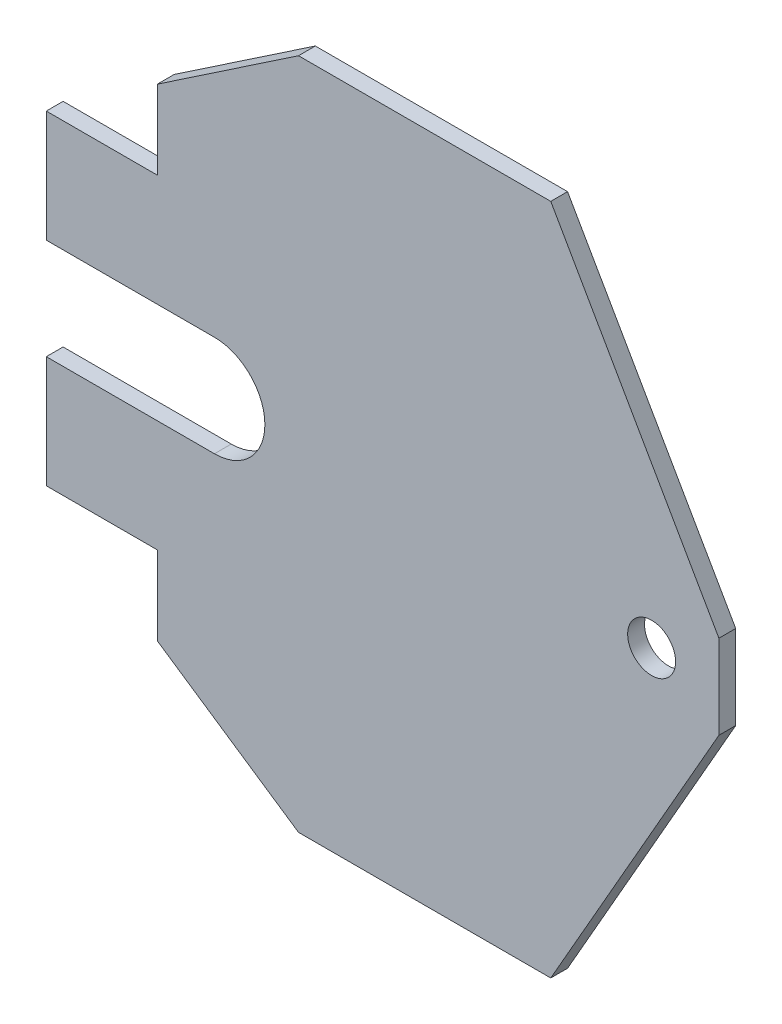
from build123d import *

# Parameters (mm, degrees)
ESQUISSE1_R          = 14.25
BASE_EXTRUSION_DEPTH = 10


with BuildPart() as part:
    # Esquisse1 → Base-Extrusion (new body)
    with BuildSketch(Plane.XY):
        with BuildLine():
            Line((40, 25), (40, -25))
            Line((40, -25), (-60, -200))
            Line((-60, -200), (-210, -200))
            Line((-210, -200), (-294, -143.341284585))
            Line((-294, -143.341284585), (-294, -96.5))
            Line((-294, -96.5), (-360, -96.5))
            Line((-360, -96.5), (-360, -30))
            Line((-360, -30), (-260, -30))
            ThreePointArc((-260, -30), (-230, 0), (-260, 30))
            Line((-260, 30), (-360, 30))
            Line((-360, 30), (-360, 96.5))
            Line((-360, 96.5), (-294, 96.5))
            Line((-294, 96.5), (-294, 143.341284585))
            Line((-294, 143.341284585), (-210, 200))
            Line((-210, 200), (-60, 200))
            Line((-60, 200), (40, 25))
        make_face()
        Circle(ESQUISSE1_R, mode=Mode.SUBTRACT)
    extrude(amount=BASE_EXTRUSION_DEPTH)


solid = part.part
